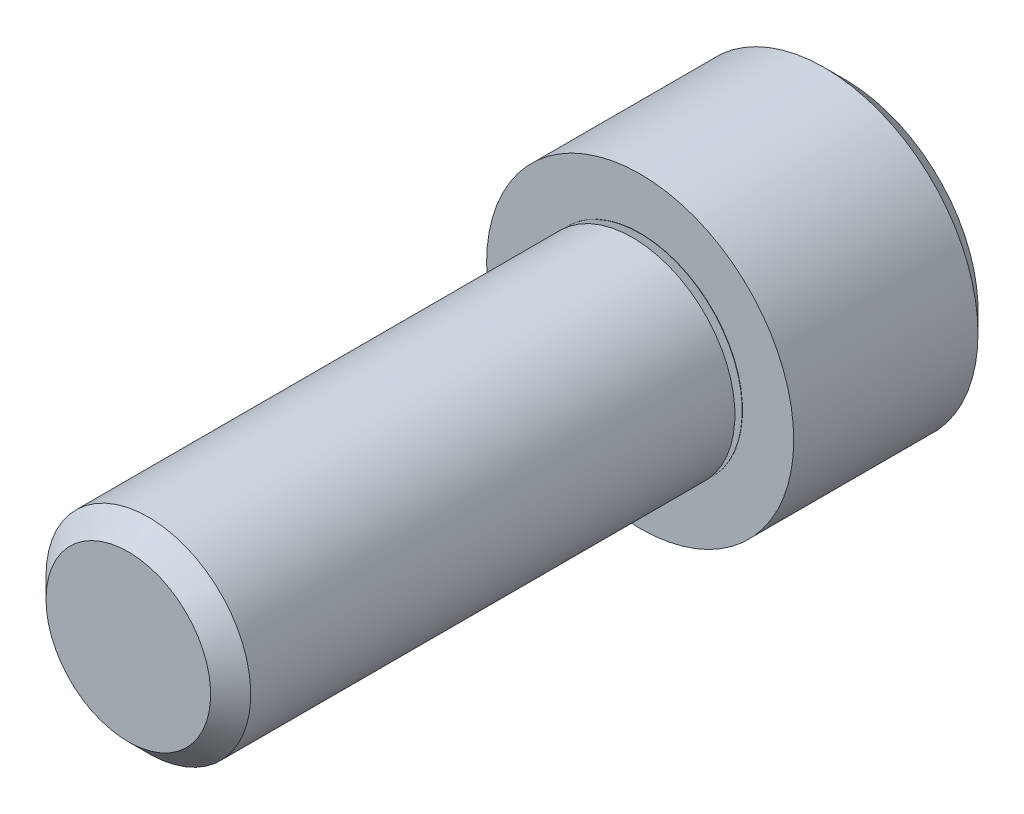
ISO-10303-21;
HEADER;
FILE_DESCRIPTION(('STEP AP214'),'2;1');
FILE_NAME('part.step','',(''),(''),'','','');
FILE_SCHEMA(('AUTOMOTIVE_DESIGN { 1 0 10303 214 1 1 1 1 }'));
ENDSEC;
DATA;
#1=APPLICATION_CONTEXT('core data for automotive mechanical design processes');
#2=APPLICATION_PROTOCOL_DEFINITION('international standard','automotive_design',2000,#1);
#3=PRODUCT_CONTEXT('',#1,'mechanical');
#4=PRODUCT('Part','Part','',(#3));
#5=PRODUCT_RELATED_PRODUCT_CATEGORY('part','',(#4));
#6=PRODUCT_DEFINITION_FORMATION('','',#4);
#7=PRODUCT_DEFINITION_CONTEXT('part definition',#1,'design');
#8=PRODUCT_DEFINITION('design','',#6,#7);
#9=PRODUCT_DEFINITION_SHAPE('','',#8);
#10=(LENGTH_UNIT() NAMED_UNIT(*) SI_UNIT(.MILLI.,.METRE.));
#11=(NAMED_UNIT(*) PLANE_ANGLE_UNIT() SI_UNIT($,.RADIAN.));
#12=(NAMED_UNIT(*) SI_UNIT($,.STERADIAN.) SOLID_ANGLE_UNIT());
#13=UNCERTAINTY_MEASURE_WITH_UNIT(LENGTH_MEASURE(1.E-05),#10,'distance_accuracy_value','');
#14=(GEOMETRIC_REPRESENTATION_CONTEXT(3) GLOBAL_UNCERTAINTY_ASSIGNED_CONTEXT((#13)) GLOBAL_UNIT_ASSIGNED_CONTEXT((#10,
#11,#12)) REPRESENTATION_CONTEXT('',''));
#15=CARTESIAN_POINT('',(0.,0.,0.));
#16=DIRECTION('',(0.,0.,1.));
#17=DIRECTION('',(1.,0.,0.));
#18=AXIS2_PLACEMENT_3D('',#15,#16,#17);
#19=CARTESIAN_POINT('',(0.,0.,-6.34999999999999));
#20=DIRECTION('',(0.,0.,1.));
#21=DIRECTION('',(1.,0.,0.));
#22=AXIS2_PLACEMENT_3D('',#19,#20,#21);
#23=PLANE('',#22);
#24=DIRECTION('',(-0.5,-0.866025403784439,0.));
#25=VECTOR('',#24,1.);
#26=CARTESIAN_POINT('',(2.74963065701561,0.,-6.34999999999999));
#27=LINE('',#26,#25);
#28=CARTESIAN_POINT('',(2.74963065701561,0.,-6.34999999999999));
#29=VERTEX_POINT('',#28);
#30=CARTESIAN_POINT('',(1.37481532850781,-2.38125,-6.34999999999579));
#31=VERTEX_POINT('',#30);
#32=EDGE_CURVE('E145',#29,#31,#27,.T.);
#33=ORIENTED_EDGE('',*,*,#32,.F.);
#34=DIRECTION('',(0.499999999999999,-0.866025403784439,0.));
#35=VECTOR('',#34,1.);
#36=CARTESIAN_POINT('',(1.37481532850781,2.38125,-6.34999999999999));
#37=LINE('',#36,#35);
#38=CARTESIAN_POINT('',(1.37481532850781,2.38125,-6.34999999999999));
#39=VERTEX_POINT('',#38);
#40=EDGE_CURVE('E64',#39,#29,#37,.T.);
#41=ORIENTED_EDGE('',*,*,#40,.F.);
#42=DIRECTION('',(1.,0.,0.));
#43=VECTOR('',#42,1.);
#44=CARTESIAN_POINT('',(-1.37481532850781,2.38125,-6.34999999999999));
#45=LINE('',#44,#43);
#46=CARTESIAN_POINT('',(-1.37481532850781,2.38125,-6.34999999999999));
#47=VERTEX_POINT('',#46);
#48=EDGE_CURVE('E158',#47,#39,#45,.T.);
#49=ORIENTED_EDGE('',*,*,#48,.F.);
#50=DIRECTION('',(0.5,0.866025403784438,0.));
#51=VECTOR('',#50,1.);
#52=CARTESIAN_POINT('',(-2.74963065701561,0.,-6.34999999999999));
#53=LINE('',#52,#51);
#54=CARTESIAN_POINT('',(-2.74963065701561,0.,-6.34999999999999));
#55=VERTEX_POINT('',#54);
#56=EDGE_CURVE('E155',#55,#47,#53,.T.);
#57=ORIENTED_EDGE('',*,*,#56,.F.);
#58=DIRECTION('',(-0.5,0.866025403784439,0.));
#59=VECTOR('',#58,1.);
#60=CARTESIAN_POINT('',(-1.37481532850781,-2.38125,-6.34999999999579));
#61=LINE('',#60,#59);
#62=CARTESIAN_POINT('',(-1.37481532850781,-2.38125,-6.34999999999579));
#63=VERTEX_POINT('',#62);
#64=EDGE_CURVE('E112',#63,#55,#61,.T.);
#65=ORIENTED_EDGE('',*,*,#64,.F.);
#66=DIRECTION('',(-1.,0.,0.));
#67=VECTOR('',#66,1.);
#68=CARTESIAN_POINT('',(1.37481532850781,-2.38125,-6.34999999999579));
#69=LINE('',#68,#67);
#70=EDGE_CURVE('E149',#31,#63,#69,.T.);
#71=ORIENTED_EDGE('',*,*,#70,.F.);
#72=EDGE_LOOP('',(#33,#41,#49,#57,#65,#71));
#73=FACE_BOUND('',#72,.T.);
#74=CARTESIAN_POINT('',(0.,0.,-6.34999999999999));
#75=DIRECTION('',(0.,0.,-1.));
#76=DIRECTION('',(-1.,0.,0.));
#77=AXIS2_PLACEMENT_3D('',#74,#75,#76);
#78=CIRCLE('',#77,4.1275);
#79=CARTESIAN_POINT('',(-4.1275,0.,-6.34999999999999));
#80=VERTEX_POINT('',#79);
#81=EDGE_CURVE('E164',#80,#80,#78,.T.);
#82=ORIENTED_EDGE('',*,*,#81,.T.);
#83=EDGE_LOOP('',(#82));
#84=FACE_BOUND('',#83,.T.);
#85=ADVANCED_FACE('F49',(#73,#84),#23,.F.);
#86=CARTESIAN_POINT('',(-2.55270000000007,0.,15.8750000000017));
#87=DIRECTION('',(0.,0.,-1.));
#88=DIRECTION('',(-1.,0.,0.));
#89=AXIS2_PLACEMENT_3D('',#86,#87,#88);
#90=PLANE('',#89);
#91=CARTESIAN_POINT('',(0.,0.,15.8750000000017));
#92=DIRECTION('',(0.,0.,-1.));
#93=DIRECTION('',(-1.,0.,0.));
#94=AXIS2_PLACEMENT_3D('',#91,#92,#93);
#95=CIRCLE('',#94,2.55270000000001);
#96=CARTESIAN_POINT('',(-2.55270000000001,0.,15.8750000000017));
#97=VERTEX_POINT('',#96);
#98=EDGE_CURVE('E11',#97,#97,#95,.T.);
#99=ORIENTED_EDGE('',*,*,#98,.F.);
#100=EDGE_LOOP('',(#99));
#101=FACE_BOUND('',#100,.T.);
#102=ADVANCED_FACE('F214',(#101),#90,.F.);
#103=CARTESIAN_POINT('',(0.,0.,15.8750000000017));
#104=DIRECTION('',(0.,0.,-1.));
#105=DIRECTION('',(-1.,0.,0.));
#106=AXIS2_PLACEMENT_3D('',#103,#104,#105);
#107=CONICAL_SURFACE('',#106,2.55270000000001,0.785398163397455);
#108=CARTESIAN_POINT('',(0.,0.,15.2527000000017));
#109=DIRECTION('',(0.,0.,-1.));
#110=DIRECTION('',(-1.,0.,0.));
#111=AXIS2_PLACEMENT_3D('',#108,#109,#110);
#112=CIRCLE('',#111,3.17500000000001);
#113=CARTESIAN_POINT('',(-3.17500000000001,0.,15.2527000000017));
#114=VERTEX_POINT('',#113);
#115=EDGE_CURVE('E57',#114,#114,#112,.T.);
#116=ORIENTED_EDGE('',*,*,#115,.F.);
#117=EDGE_LOOP('',(#116));
#118=FACE_BOUND('',#117,.T.);
#119=ORIENTED_EDGE('',*,*,#98,.T.);
#120=EDGE_LOOP('',(#119));
#121=FACE_BOUND('',#120,.T.);
#122=ADVANCED_FACE('F211',(#118,#121),#107,.T.);
#123=CARTESIAN_POINT('',(0.,0.,-10.5851546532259));
#124=DIRECTION('',(0.,0.,-1.));
#125=DIRECTION('',(-1.,0.,0.));
#126=AXIS2_PLACEMENT_3D('',#123,#124,#125);
#127=CYLINDRICAL_SURFACE('',#126,3.17500000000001);
#128=CARTESIAN_POINT('',(0.,0.,0.236498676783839));
#129=DIRECTION('',(0.,0.,-1.));
#130=DIRECTION('',(-1.,0.,0.));
#131=AXIS2_PLACEMENT_3D('',#128,#129,#130);
#132=CIRCLE('',#131,3.17500000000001);
#133=CARTESIAN_POINT('',(-3.17500000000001,0.,0.236498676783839));
#134=VERTEX_POINT('',#133);
#135=EDGE_CURVE('E201',#134,#134,#132,.T.);
#136=ORIENTED_EDGE('',*,*,#135,.F.);
#137=EDGE_LOOP('',(#136));
#138=FACE_BOUND('',#137,.T.);
#139=ORIENTED_EDGE('',*,*,#115,.T.);
#140=EDGE_LOOP('',(#139));
#141=FACE_BOUND('',#140,.T.);
#142=ADVANCED_FACE('F209',(#138,#141),#127,.T.);
#143=CARTESIAN_POINT('',(0.,0.,0.236498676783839));
#144=DIRECTION('',(0.,0.,1.));
#145=DIRECTION('',(1.,0.,0.));
#146=AXIS2_PLACEMENT_3D('',#143,#144,#145);
#147=CONICAL_SURFACE('',#146,3.17500000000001,1.22173047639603);
#148=CARTESIAN_POINT('',(0.,0.,0.0487938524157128));
#149=DIRECTION('',(0.,0.,-1.));
#150=DIRECTION('',(-1.,0.,0.));
#151=AXIS2_PLACEMENT_3D('',#148,#149,#150);
#152=CIRCLE('',#151,2.65928523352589);
#153=CARTESIAN_POINT('',(-2.65928523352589,0.,0.0487938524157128));
#154=VERTEX_POINT('',#153);
#155=EDGE_CURVE('E197',#154,#154,#152,.T.);
#156=ORIENTED_EDGE('',*,*,#155,.F.);
#157=EDGE_LOOP('',(#156));
#158=FACE_BOUND('',#157,.T.);
#159=ORIENTED_EDGE('',*,*,#135,.T.);
#160=EDGE_LOOP('',(#159));
#161=FACE_BOUND('',#160,.T.);
#162=ADVANCED_FACE('F227',(#158,#161),#147,.T.);
#163=CARTESIAN_POINT('',(0.,0.,0.0300000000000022));
#164=DIRECTION('',(0.,0.,-1.));
#165=DIRECTION('',(-1.,0.,0.));
#166=AXIS2_PLACEMENT_3D('',#163,#164,#165);
#167=TOROIDAL_SURFACE('',#166,2.6661256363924,0.0199999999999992);
#168=CARTESIAN_POINT('',(0.,0.,0.01000000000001));
#169=DIRECTION('',(0.,0.,-1.));
#170=DIRECTION('',(-1.,0.,0.));
#171=AXIS2_PLACEMENT_3D('',#168,#169,#170);
#172=CIRCLE('',#171,2.6661256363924);
#173=CARTESIAN_POINT('',(-2.6661256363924,0.,0.01000000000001));
#174=VERTEX_POINT('',#173);
#175=EDGE_CURVE('E193',#174,#174,#172,.T.);
#176=ORIENTED_EDGE('',*,*,#175,.F.);
#177=EDGE_LOOP('',(#176));
#178=FACE_BOUND('',#177,.T.);
#179=ORIENTED_EDGE('',*,*,#155,.T.);
#180=EDGE_LOOP('',(#179));
#181=FACE_BOUND('',#180,.T.);
#182=ADVANCED_FACE('F231',(#178,#181),#167,.F.);
#183=CARTESIAN_POINT('',(-3.17499999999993,0.,0.00999999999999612));
#184=DIRECTION('',(0.,0.,-1.));
#185=DIRECTION('',(-1.,0.,0.));
#186=AXIS2_PLACEMENT_3D('',#183,#184,#185);
#187=PLANE('',#186);
#188=CARTESIAN_POINT('',(0.,0.,0.00999999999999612));
#189=DIRECTION('',(0.,0.,-1.));
#190=DIRECTION('',(-1.,0.,0.));
#191=AXIS2_PLACEMENT_3D('',#188,#189,#190);
#192=CIRCLE('',#191,3.175);
#193=CARTESIAN_POINT('',(-3.175,0.,0.00999999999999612));
#194=VERTEX_POINT('',#193);
#195=EDGE_CURVE('E189',#194,#194,#192,.T.);
#196=ORIENTED_EDGE('',*,*,#195,.F.);
#197=EDGE_LOOP('',(#196));
#198=FACE_BOUND('',#197,.T.);
#199=ORIENTED_EDGE('',*,*,#175,.T.);
#200=EDGE_LOOP('',(#199));
#201=FACE_BOUND('',#200,.T.);
#202=ADVANCED_FACE('F235',(#198,#201),#187,.F.);
#203=CARTESIAN_POINT('',(0.,0.,-10.5851546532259));
#204=DIRECTION('',(0.,0.,-1.));
#205=DIRECTION('',(-1.,0.,0.));
#206=AXIS2_PLACEMENT_3D('',#203,#204,#205);
#207=CYLINDRICAL_SURFACE('',#206,3.175);
#208=CARTESIAN_POINT('',(0.,0.,0.));
#209=DIRECTION('',(0.,0.,-1.));
#210=DIRECTION('',(-1.,0.,0.));
#211=AXIS2_PLACEMENT_3D('',#208,#209,#210);
#212=CIRCLE('',#211,3.175);
#213=CARTESIAN_POINT('',(-3.175,0.,0.));
#214=VERTEX_POINT('',#213);
#215=EDGE_CURVE('E185',#214,#214,#212,.T.);
#216=ORIENTED_EDGE('',*,*,#215,.F.);
#217=EDGE_LOOP('',(#216));
#218=FACE_BOUND('',#217,.T.);
#219=ORIENTED_EDGE('',*,*,#195,.T.);
#220=EDGE_LOOP('',(#219));
#221=FACE_BOUND('',#220,.T.);
#222=ADVANCED_FACE('F239',(#218,#221),#207,.T.);
#223=CARTESIAN_POINT('',(-4.7625,0.,0.));
#224=DIRECTION('',(0.,0.,-1.));
#225=DIRECTION('',(-1.,0.,0.));
#226=AXIS2_PLACEMENT_3D('',#223,#224,#225);
#227=PLANE('',#226);
#228=CARTESIAN_POINT('',(0.,0.,0.));
#229=DIRECTION('',(0.,0.,-1.));
#230=DIRECTION('',(-1.,0.,0.));
#231=AXIS2_PLACEMENT_3D('',#228,#229,#230);
#232=CIRCLE('',#231,4.7625);
#233=CARTESIAN_POINT('',(-4.7625,0.,0.));
#234=VERTEX_POINT('',#233);
#235=EDGE_CURVE('E181',#234,#234,#232,.T.);
#236=ORIENTED_EDGE('',*,*,#235,.F.);
#237=EDGE_LOOP('',(#236));
#238=FACE_BOUND('',#237,.T.);
#239=ORIENTED_EDGE('',*,*,#215,.T.);
#240=EDGE_LOOP('',(#239));
#241=FACE_BOUND('',#240,.T.);
#242=ADVANCED_FACE('F243',(#238,#241),#227,.F.);
#243=CARTESIAN_POINT('',(0.,0.,-10.5851546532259));
#244=DIRECTION('',(0.,0.,-1.));
#245=DIRECTION('',(-1.,0.,0.));
#246=AXIS2_PLACEMENT_3D('',#243,#244,#245);
#247=CYLINDRICAL_SURFACE('',#246,4.7625);
#248=CARTESIAN_POINT('',(0.,0.,-5.715));
#249=DIRECTION('',(0.,0.,-1.));
#250=DIRECTION('',(-1.,0.,0.));
#251=AXIS2_PLACEMENT_3D('',#248,#249,#250);
#252=CIRCLE('',#251,4.7625);
#253=CARTESIAN_POINT('',(-4.7625,0.,-5.715));
#254=VERTEX_POINT('',#253);
#255=EDGE_CURVE('E177',#254,#254,#252,.T.);
#256=ORIENTED_EDGE('',*,*,#255,.F.);
#257=EDGE_LOOP('',(#256));
#258=FACE_BOUND('',#257,.T.);
#259=ORIENTED_EDGE('',*,*,#235,.T.);
#260=EDGE_LOOP('',(#259));
#261=FACE_BOUND('',#260,.T.);
#262=ADVANCED_FACE('F247',(#258,#261),#247,.T.);
#263=CARTESIAN_POINT('',(0.,0.,-5.715));
#264=DIRECTION('',(0.,0.,1.));
#265=DIRECTION('',(1.,0.,0.));
#266=AXIS2_PLACEMENT_3D('',#263,#264,#265);
#267=CONICAL_SURFACE('',#266,4.7625,0.785398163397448);
#268=ORIENTED_EDGE('',*,*,#81,.F.);
#269=EDGE_LOOP('',(#268));
#270=FACE_BOUND('',#269,.T.);
#271=ORIENTED_EDGE('',*,*,#255,.T.);
#272=EDGE_LOOP('',(#271));
#273=FACE_BOUND('',#272,.T.);
#274=ADVANCED_FACE('F251',(#270,#273),#267,.T.);
#275=CARTESIAN_POINT('',(1.37481532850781,2.38125,-3.175));
#276=DIRECTION('',(0.866025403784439,0.499999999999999,0.));
#277=DIRECTION('',(-0.5,0.866025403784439,0.));
#278=AXIS2_PLACEMENT_3D('',#275,#276,#277);
#279=PLANE('',#278);
#280=ORIENTED_EDGE('',*,*,#40,.T.);
#281=DIRECTION('',(0.,0.,-1.));
#282=VECTOR('',#281,1.);
#283=CARTESIAN_POINT('',(2.74963065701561,0.,-3.175));
#284=LINE('',#283,#282);
#285=CARTESIAN_POINT('',(2.74963065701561,0.,-3.175));
#286=VERTEX_POINT('',#285);
#287=EDGE_CURVE('E94',#286,#29,#284,.T.);
#288=ORIENTED_EDGE('',*,*,#287,.F.);
#289=DIRECTION('',(0.499999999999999,-0.866025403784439,0.));
#290=VECTOR('',#289,1.);
#291=CARTESIAN_POINT('',(1.37481532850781,2.38125,-3.175));
#292=LINE('',#291,#290);
#293=CARTESIAN_POINT('',(1.37481532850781,2.38125,-3.175));
#294=VERTEX_POINT('',#293);
#295=EDGE_CURVE('E161',#294,#286,#292,.T.);
#296=ORIENTED_EDGE('',*,*,#295,.F.);
#297=DIRECTION('',(0.,0.,-1.));
#298=VECTOR('',#297,1.);
#299=CARTESIAN_POINT('',(1.37481532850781,2.38125,-3.175));
#300=LINE('',#299,#298);
#301=EDGE_CURVE('E72',#294,#39,#300,.T.);
#302=ORIENTED_EDGE('',*,*,#301,.T.);
#303=EDGE_LOOP('',(#280,#288,#296,#302));
#304=FACE_BOUND('',#303,.T.);
#305=ADVANCED_FACE('F255',(#304),#279,.F.);
#306=CARTESIAN_POINT('',(-1.37481532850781,2.38125,-3.175));
#307=DIRECTION('',(0.,1.,0.));
#308=DIRECTION('',(-1.,0.,0.));
#309=AXIS2_PLACEMENT_3D('',#306,#307,#308);
#310=PLANE('',#309);
#311=ORIENTED_EDGE('',*,*,#48,.T.);
#312=ORIENTED_EDGE('',*,*,#301,.F.);
#313=DIRECTION('',(1.,0.,0.));
#314=VECTOR('',#313,1.);
#315=CARTESIAN_POINT('',(-1.37481532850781,2.38125,-3.175));
#316=LINE('',#315,#314);
#317=CARTESIAN_POINT('',(-1.37481532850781,2.38125,-3.175));
#318=VERTEX_POINT('',#317);
#319=EDGE_CURVE('E126',#318,#294,#316,.T.);
#320=ORIENTED_EDGE('',*,*,#319,.F.);
#321=DIRECTION('',(0.,0.,-1.));
#322=VECTOR('',#321,1.);
#323=CARTESIAN_POINT('',(-1.37481532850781,2.38125,-3.175));
#324=LINE('',#323,#322);
#325=EDGE_CURVE('E117',#318,#47,#324,.T.);
#326=ORIENTED_EDGE('',*,*,#325,.T.);
#327=EDGE_LOOP('',(#311,#312,#320,#326));
#328=FACE_BOUND('',#327,.T.);
#329=ADVANCED_FACE('F259',(#328),#310,.F.);
#330=CARTESIAN_POINT('',(-2.74963065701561,0.,-3.175));
#331=DIRECTION('',(-0.866025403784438,0.5,0.));
#332=DIRECTION('',(-0.5,-0.866025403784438,0.));
#333=AXIS2_PLACEMENT_3D('',#330,#331,#332);
#334=PLANE('',#333);
#335=ORIENTED_EDGE('',*,*,#56,.T.);
#336=ORIENTED_EDGE('',*,*,#325,.F.);
#337=DIRECTION('',(0.5,0.866025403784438,0.));
#338=VECTOR('',#337,1.);
#339=CARTESIAN_POINT('',(-2.74963065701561,0.,-3.175));
#340=LINE('',#339,#338);
#341=CARTESIAN_POINT('',(-2.74963065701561,0.,-3.175));
#342=VERTEX_POINT('',#341);
#343=EDGE_CURVE('E121',#342,#318,#340,.T.);
#344=ORIENTED_EDGE('',*,*,#343,.F.);
#345=DIRECTION('',(0.,0.,-1.));
#346=VECTOR('',#345,1.);
#347=CARTESIAN_POINT('',(-2.74963065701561,0.,-3.175));
#348=LINE('',#347,#346);
#349=EDGE_CURVE('E105',#342,#55,#348,.T.);
#350=ORIENTED_EDGE('',*,*,#349,.T.);
#351=EDGE_LOOP('',(#335,#336,#344,#350));
#352=FACE_BOUND('',#351,.T.);
#353=ADVANCED_FACE('F122',(#352),#334,.F.);
#354=CARTESIAN_POINT('',(-1.37481532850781,-2.38125,-3.17499999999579));
#355=DIRECTION('',(-0.866025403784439,-0.5,0.));
#356=DIRECTION('',(0.5,-0.866025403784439,0.));
#357=AXIS2_PLACEMENT_3D('',#354,#355,#356);
#358=PLANE('',#357);
#359=ORIENTED_EDGE('',*,*,#64,.T.);
#360=ORIENTED_EDGE('',*,*,#349,.F.);
#361=DIRECTION('',(-0.5,0.866025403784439,0.));
#362=VECTOR('',#361,1.);
#363=CARTESIAN_POINT('',(-1.37481532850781,-2.38125,-3.17499999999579));
#364=LINE('',#363,#362);
#365=CARTESIAN_POINT('',(-1.37481532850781,-2.38125,-3.17499999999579));
#366=VERTEX_POINT('',#365);
#367=EDGE_CURVE('E109',#366,#342,#364,.T.);
#368=ORIENTED_EDGE('',*,*,#367,.F.);
#369=DIRECTION('',(0.,0.,-1.));
#370=VECTOR('',#369,1.);
#371=CARTESIAN_POINT('',(-1.37481532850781,-2.38125,-3.17499999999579));
#372=LINE('',#371,#370);
#373=EDGE_CURVE('E118',#366,#63,#372,.T.);
#374=ORIENTED_EDGE('',*,*,#373,.T.);
#375=EDGE_LOOP('',(#359,#360,#368,#374));
#376=FACE_BOUND('',#375,.T.);
#377=ADVANCED_FACE('F107',(#376),#358,.F.);
#378=CARTESIAN_POINT('',(1.37481532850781,-2.38125,-3.17499999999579));
#379=DIRECTION('',(0.,-1.,0.));
#380=DIRECTION('',(0.,0.,-1.));
#381=AXIS2_PLACEMENT_3D('',#378,#379,#380);
#382=PLANE('',#381);
#383=ORIENTED_EDGE('',*,*,#70,.T.);
#384=ORIENTED_EDGE('',*,*,#373,.F.);
#385=DIRECTION('',(-1.,0.,0.));
#386=VECTOR('',#385,1.);
#387=CARTESIAN_POINT('',(1.37481532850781,-2.38125,-3.17499999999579));
#388=LINE('',#387,#386);
#389=CARTESIAN_POINT('',(1.37481532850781,-2.38125,-3.17499999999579));
#390=VERTEX_POINT('',#389);
#391=EDGE_CURVE('E132',#390,#366,#388,.T.);
#392=ORIENTED_EDGE('',*,*,#391,.F.);
#393=DIRECTION('',(0.,0.,-1.));
#394=VECTOR('',#393,1.);
#395=CARTESIAN_POINT('',(1.37481532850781,-2.38125,-3.17499999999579));
#396=LINE('',#395,#394);
#397=EDGE_CURVE('E169',#390,#31,#396,.T.);
#398=ORIENTED_EDGE('',*,*,#397,.T.);
#399=EDGE_LOOP('',(#383,#384,#392,#398));
#400=FACE_BOUND('',#399,.T.);
#401=ADVANCED_FACE('F263',(#400),#382,.F.);
#402=CARTESIAN_POINT('',(2.74963065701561,0.,-3.175));
#403=DIRECTION('',(0.866025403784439,-0.5,0.));
#404=DIRECTION('',(0.5,0.866025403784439,0.));
#405=AXIS2_PLACEMENT_3D('',#402,#403,#404);
#406=PLANE('',#405);
#407=ORIENTED_EDGE('',*,*,#32,.T.);
#408=ORIENTED_EDGE('',*,*,#397,.F.);
#409=DIRECTION('',(-0.5,-0.866025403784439,0.));
#410=VECTOR('',#409,1.);
#411=CARTESIAN_POINT('',(2.74963065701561,0.,-3.175));
#412=LINE('',#411,#410);
#413=EDGE_CURVE('E137',#286,#390,#412,.T.);
#414=ORIENTED_EDGE('',*,*,#413,.F.);
#415=ORIENTED_EDGE('',*,*,#287,.T.);
#416=EDGE_LOOP('',(#407,#408,#414,#415));
#417=FACE_BOUND('',#416,.T.);
#418=ADVANCED_FACE('F260',(#417),#406,.F.);
#419=CARTESIAN_POINT('',(1.37481532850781,2.38125,-3.175));
#420=DIRECTION('',(0.,0.,1.));
#421=DIRECTION('',(1.,0.,0.));
#422=AXIS2_PLACEMENT_3D('',#419,#420,#421);
#423=PLANE('',#422);
#424=ORIENTED_EDGE('',*,*,#295,.T.);
#425=ORIENTED_EDGE('',*,*,#413,.T.);
#426=ORIENTED_EDGE('',*,*,#391,.T.);
#427=ORIENTED_EDGE('',*,*,#367,.T.);
#428=ORIENTED_EDGE('',*,*,#343,.T.);
#429=ORIENTED_EDGE('',*,*,#319,.T.);
#430=EDGE_LOOP('',(#424,#425,#426,#427,#428,#429));
#431=FACE_BOUND('',#430,.T.);
#432=ADVANCED_FACE('F129',(#431),#423,.F.);
#433=CLOSED_SHELL('',(#85,#102,#122,#142,#162,#182,#202,#222,#242,#262,#274,#305,#329,#353,#377,
#401,#418,#432));
#434=MANIFOLD_SOLID_BREP('B2',#433);
#435=ADVANCED_BREP_SHAPE_REPRESENTATION('',(#18,#434),#14);
#436=SHAPE_DEFINITION_REPRESENTATION(#9,#435);
ENDSEC;
END-ISO-10303-21;
